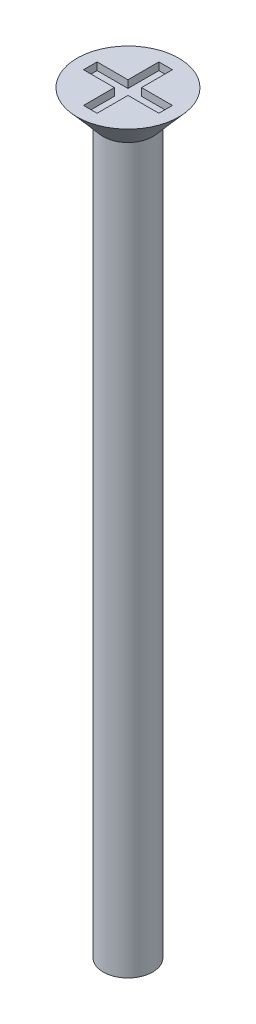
ISO-10303-21;
HEADER;
FILE_DESCRIPTION(('STEP AP214'),'2;1');
FILE_NAME('part.step','',(''),(''),'','','');
FILE_SCHEMA(('AUTOMOTIVE_DESIGN { 1 0 10303 214 1 1 1 1 }'));
ENDSEC;
DATA;
#1=APPLICATION_CONTEXT('core data for automotive mechanical design processes');
#2=APPLICATION_PROTOCOL_DEFINITION('international standard','automotive_design',2000,#1);
#3=PRODUCT_CONTEXT('',#1,'mechanical');
#4=PRODUCT('Part','Part','',(#3));
#5=PRODUCT_RELATED_PRODUCT_CATEGORY('part','',(#4));
#6=PRODUCT_DEFINITION_FORMATION('','',#4);
#7=PRODUCT_DEFINITION_CONTEXT('part definition',#1,'design');
#8=PRODUCT_DEFINITION('design','',#6,#7);
#9=PRODUCT_DEFINITION_SHAPE('','',#8);
#10=(LENGTH_UNIT() NAMED_UNIT(*) SI_UNIT(.MILLI.,.METRE.));
#11=(NAMED_UNIT(*) PLANE_ANGLE_UNIT() SI_UNIT($,.RADIAN.));
#12=(NAMED_UNIT(*) SI_UNIT($,.STERADIAN.) SOLID_ANGLE_UNIT());
#13=UNCERTAINTY_MEASURE_WITH_UNIT(LENGTH_MEASURE(1.E-05),#10,'distance_accuracy_value','');
#14=(GEOMETRIC_REPRESENTATION_CONTEXT(3) GLOBAL_UNCERTAINTY_ASSIGNED_CONTEXT((#13)) GLOBAL_UNIT_ASSIGNED_CONTEXT((#10,
#11,#12)) REPRESENTATION_CONTEXT('',''));
#15=CARTESIAN_POINT('',(0.,0.,0.));
#16=DIRECTION('',(0.,0.,1.));
#17=DIRECTION('',(1.,0.,0.));
#18=AXIS2_PLACEMENT_3D('',#15,#16,#17);
#19=CARTESIAN_POINT('',(4.2907883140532,63.5,0.));
#20=DIRECTION('',(0.,-1.,0.));
#21=DIRECTION('',(0.,0.,-1.));
#22=AXIS2_PLACEMENT_3D('',#19,#20,#21);
#23=PLANE('',#22);
#24=CARTESIAN_POINT('',(0.,63.5,0.));
#25=DIRECTION('',(0.,1.,0.));
#26=DIRECTION('',(0.,0.,1.));
#27=AXIS2_PLACEMENT_3D('',#24,#25,#26);
#28=CIRCLE('',#27,4.2907883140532);
#29=CARTESIAN_POINT('',(0.,63.5,4.2907883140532));
#30=VERTEX_POINT('',#29);
#31=EDGE_CURVE('E228',#30,#30,#28,.T.);
#32=ORIENTED_EDGE('',*,*,#31,.T.);
#33=EDGE_LOOP('',(#32));
#34=FACE_BOUND('',#33,.T.);
#35=DIRECTION('',(-1.,0.,1.49574714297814E-09));
#36=VECTOR('',#35,1.);
#37=CARTESIAN_POINT('',(8.54819492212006E-10,63.5,0.571499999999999));
#38=LINE('',#37,#36);
#39=CARTESIAN_POINT('',(-0.571500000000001,63.5,0.571500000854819));
#40=VERTEX_POINT('',#39);
#41=CARTESIAN_POINT('',(-3.17499999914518,63.5,0.571500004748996));
#42=VERTEX_POINT('',#41);
#43=EDGE_CURVE('E186',#40,#42,#38,.T.);
#44=ORIENTED_EDGE('',*,*,#43,.T.);
#45=DIRECTION('',(1.49574941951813E-09,0.,1.));
#46=VECTOR('',#45,1.);
#47=CARTESIAN_POINT('',(-3.17500000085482,63.5,-0.571499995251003));
#48=LINE('',#47,#46);
#49=CARTESIAN_POINT('',(-3.17500000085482,63.5,-0.571499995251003));
#50=VERTEX_POINT('',#49);
#51=EDGE_CURVE('E188',#50,#42,#48,.T.);
#52=ORIENTED_EDGE('',*,*,#51,.F.);
#53=DIRECTION('',(1.,0.,-1.49574727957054E-09));
#54=VECTOR('',#53,1.);
#55=CARTESIAN_POINT('',(-3.17500000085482,63.5,-0.571499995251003));
#56=LINE('',#55,#54);
#57=CARTESIAN_POINT('',(-0.571500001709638,63.5,-0.571500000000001));
#58=VERTEX_POINT('',#57);
#59=EDGE_CURVE('E191',#50,#58,#56,.T.);
#60=ORIENTED_EDGE('',*,*,#59,.T.);
#61=DIRECTION('',(-2.99149428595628E-09,0.,-1.));
#62=VECTOR('',#61,1.);
#63=CARTESIAN_POINT('',(-0.571499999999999,63.5,1.70963898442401E-09));
#64=LINE('',#63,#62);
#65=CARTESIAN_POINT('',(-0.571500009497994,63.5,-3.17499999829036));
#66=VERTEX_POINT('',#65);
#67=EDGE_CURVE('E165',#58,#66,#64,.T.);
#68=ORIENTED_EDGE('',*,*,#67,.T.);
#69=DIRECTION('',(-1.,0.,2.99149656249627E-09));
#70=VECTOR('',#69,1.);
#71=CARTESIAN_POINT('',(0.571499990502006,63.5,-3.17500000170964));
#72=LINE('',#71,#70);
#73=CARTESIAN_POINT('',(0.571499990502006,63.5,-3.17500000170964));
#74=VERTEX_POINT('',#73);
#75=EDGE_CURVE('E168',#74,#66,#72,.T.);
#76=ORIENTED_EDGE('',*,*,#75,.F.);
#77=DIRECTION('',(2.99149442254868E-09,0.,1.));
#78=VECTOR('',#77,1.);
#79=CARTESIAN_POINT('',(0.571499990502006,63.5,-3.17500000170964));
#80=LINE('',#79,#78);
#81=CARTESIAN_POINT('',(0.571500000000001,63.5,-0.571500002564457));
#82=VERTEX_POINT('',#81);
#83=EDGE_CURVE('E154',#74,#82,#80,.T.);
#84=ORIENTED_EDGE('',*,*,#83,.T.);
#85=DIRECTION('',(1.,0.,-4.48724098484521E-09));
#86=VECTOR('',#85,1.);
#87=CARTESIAN_POINT('',(-2.56445822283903E-09,63.5,-0.571499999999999));
#88=LINE('',#87,#86);
#89=CARTESIAN_POINT('',(3.17499999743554,63.5,-0.571500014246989));
#90=VERTEX_POINT('',#89);
#91=EDGE_CURVE('E134',#82,#90,#88,.T.);
#92=ORIENTED_EDGE('',*,*,#91,.T.);
#93=DIRECTION('',(-4.48724326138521E-09,0.,-1.));
#94=VECTOR('',#93,1.);
#95=CARTESIAN_POINT('',(3.17500000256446,63.5,0.57149998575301));
#96=LINE('',#95,#94);
#97=CARTESIAN_POINT('',(3.17500000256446,63.5,0.57149998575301));
#98=VERTEX_POINT('',#97);
#99=EDGE_CURVE('E144',#98,#90,#96,.T.);
#100=ORIENTED_EDGE('',*,*,#99,.F.);
#101=DIRECTION('',(-1.,0.,4.48724112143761E-09));
#102=VECTOR('',#101,1.);
#103=CARTESIAN_POINT('',(3.17500000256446,63.5,0.57149998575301));
#104=LINE('',#103,#102);
#105=CARTESIAN_POINT('',(0.571499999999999,63.5,0.571499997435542));
#106=VERTEX_POINT('',#105);
#107=EDGE_CURVE('E149',#98,#106,#104,.T.);
#108=ORIENTED_EDGE('',*,*,#107,.T.);
#109=DIRECTION('',(0.,0.,1.));
#110=VECTOR('',#109,1.);
#111=CARTESIAN_POINT('',(0.571499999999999,63.5,0.));
#112=LINE('',#111,#110);
#113=CARTESIAN_POINT('',(0.571499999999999,63.5,3.175));
#114=VERTEX_POINT('',#113);
#115=EDGE_CURVE('E211',#106,#114,#112,.T.);
#116=ORIENTED_EDGE('',*,*,#115,.T.);
#117=DIRECTION('',(1.,0.,0.));
#118=VECTOR('',#117,1.);
#119=CARTESIAN_POINT('',(-0.5715,63.5,3.175));
#120=LINE('',#119,#118);
#121=CARTESIAN_POINT('',(-0.5715,63.5,3.175));
#122=VERTEX_POINT('',#121);
#123=EDGE_CURVE('E213',#122,#114,#120,.T.);
#124=ORIENTED_EDGE('',*,*,#123,.F.);
#125=DIRECTION('',(0.,0.,-1.));
#126=VECTOR('',#125,1.);
#127=CARTESIAN_POINT('',(-0.5715,63.5,3.175));
#128=LINE('',#127,#126);
#129=EDGE_CURVE('E216',#122,#40,#128,.T.);
#130=ORIENTED_EDGE('',*,*,#129,.T.);
#131=EDGE_LOOP('',(#44,#52,#60,#68,#76,#84,#92,#100,#108,#116,#124,#130));
#132=FACE_BOUND('',#131,.T.);
#133=ADVANCED_FACE('F37',(#34,#132),#23,.F.);
#134=CARTESIAN_POINT('',(0.571499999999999,62.865,0.));
#135=DIRECTION('',(-1.,0.,0.));
#136=DIRECTION('',(0.,0.,1.));
#137=AXIS2_PLACEMENT_3D('',#134,#135,#136);
#138=PLANE('',#137);
#139=ORIENTED_EDGE('',*,*,#115,.F.);
#140=DIRECTION('',(0.,-1.,0.));
#141=VECTOR('',#140,1.);
#142=CARTESIAN_POINT('',(0.571499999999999,62.865,0.571499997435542));
#143=LINE('',#142,#141);
#144=CARTESIAN_POINT('',(0.571499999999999,62.865,0.571499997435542));
#145=VERTEX_POINT('',#144);
#146=EDGE_CURVE('E206',#106,#145,#143,.T.);
#147=ORIENTED_EDGE('',*,*,#146,.T.);
#148=DIRECTION('',(0.,0.,1.));
#149=VECTOR('',#148,1.);
#150=CARTESIAN_POINT('',(0.571499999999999,62.865,0.));
#151=LINE('',#150,#149);
#152=CARTESIAN_POINT('',(0.571499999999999,62.865,3.175));
#153=VERTEX_POINT('',#152);
#154=EDGE_CURVE('E60',#145,#153,#151,.T.);
#155=ORIENTED_EDGE('',*,*,#154,.T.);
#156=DIRECTION('',(0.,1.,0.));
#157=VECTOR('',#156,1.);
#158=CARTESIAN_POINT('',(0.571499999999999,62.865,3.175));
#159=LINE('',#158,#157);
#160=EDGE_CURVE('E226',#153,#114,#159,.T.);
#161=ORIENTED_EDGE('',*,*,#160,.T.);
#162=EDGE_LOOP('',(#139,#147,#155,#161));
#163=FACE_BOUND('',#162,.T.);
#164=ADVANCED_FACE('F245',(#163),#138,.T.);
#165=CARTESIAN_POINT('',(-0.5715,62.865,3.175));
#166=DIRECTION('',(1.,0.,0.));
#167=DIRECTION('',(0.,0.,-1.));
#168=AXIS2_PLACEMENT_3D('',#165,#166,#167);
#169=PLANE('',#168);
#170=DIRECTION('',(0.,0.,-1.));
#171=VECTOR('',#170,1.);
#172=CARTESIAN_POINT('',(-0.5715,62.865,3.175));
#173=LINE('',#172,#171);
#174=CARTESIAN_POINT('',(-0.5715,62.865,3.175));
#175=VERTEX_POINT('',#174);
#176=CARTESIAN_POINT('',(-0.571500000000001,62.865,0.571500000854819));
#177=VERTEX_POINT('',#176);
#178=EDGE_CURVE('E223',#175,#177,#173,.T.);
#179=ORIENTED_EDGE('',*,*,#178,.T.);
#180=DIRECTION('',(0.,1.,0.));
#181=VECTOR('',#180,1.);
#182=CARTESIAN_POINT('',(-0.571500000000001,62.865,0.571500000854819));
#183=LINE('',#182,#181);
#184=EDGE_CURVE('E208',#177,#40,#183,.T.);
#185=ORIENTED_EDGE('',*,*,#184,.T.);
#186=ORIENTED_EDGE('',*,*,#129,.F.);
#187=DIRECTION('',(0.,1.,0.));
#188=VECTOR('',#187,1.);
#189=CARTESIAN_POINT('',(-0.5715,62.865,3.175));
#190=LINE('',#189,#188);
#191=EDGE_CURVE('E52',#175,#122,#190,.T.);
#192=ORIENTED_EDGE('',*,*,#191,.F.);
#193=EDGE_LOOP('',(#179,#185,#186,#192));
#194=FACE_BOUND('',#193,.T.);
#195=ADVANCED_FACE('F241',(#194),#169,.T.);
#196=CARTESIAN_POINT('',(0.,0.,0.));
#197=DIRECTION('',(0.,1.,0.));
#198=DIRECTION('',(0.,0.,1.));
#199=AXIS2_PLACEMENT_3D('',#196,#197,#198);
#200=PLANE('',#199);
#201=CARTESIAN_POINT('',(0.,0.,0.));
#202=DIRECTION('',(0.,1.,0.));
#203=DIRECTION('',(0.,0.,1.));
#204=AXIS2_PLACEMENT_3D('',#201,#202,#203);
#205=CIRCLE('',#204,2.08280000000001);
#206=CARTESIAN_POINT('',(0.,0.,2.08280000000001));
#207=VERTEX_POINT('',#206);
#208=EDGE_CURVE('E11',#207,#207,#205,.T.);
#209=ORIENTED_EDGE('',*,*,#208,.F.);
#210=EDGE_LOOP('',(#209));
#211=FACE_BOUND('',#210,.T.);
#212=ADVANCED_FACE('F39',(#211),#200,.F.);
#213=CARTESIAN_POINT('',(0.,90.8693037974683,0.));
#214=DIRECTION('',(0.,1.,0.));
#215=DIRECTION('',(0.,0.,1.));
#216=AXIS2_PLACEMENT_3D('',#213,#214,#215);
#217=CYLINDRICAL_SURFACE('',#216,2.08280000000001);
#218=CARTESIAN_POINT('',(0.,60.96,0.));
#219=DIRECTION('',(0.,1.,0.));
#220=DIRECTION('',(0.,0.,1.));
#221=AXIS2_PLACEMENT_3D('',#218,#219,#220);
#222=CIRCLE('',#221,2.08280000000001);
#223=CARTESIAN_POINT('',(0.,60.96,2.08280000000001));
#224=VERTEX_POINT('',#223);
#225=EDGE_CURVE('E45',#224,#224,#222,.T.);
#226=ORIENTED_EDGE('',*,*,#225,.F.);
#227=EDGE_LOOP('',(#226));
#228=FACE_BOUND('',#227,.T.);
#229=ORIENTED_EDGE('',*,*,#208,.T.);
#230=EDGE_LOOP('',(#229));
#231=FACE_BOUND('',#230,.T.);
#232=ADVANCED_FACE('F235',(#228,#231),#217,.T.);
#233=CARTESIAN_POINT('',(0.,60.96,0.));
#234=DIRECTION('',(0.,1.,0.));
#235=DIRECTION('',(0.,0.,1.));
#236=AXIS2_PLACEMENT_3D('',#233,#234,#235);
#237=CONICAL_SURFACE('',#236,2.08280000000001,0.715584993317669);
#238=ORIENTED_EDGE('',*,*,#31,.F.);
#239=EDGE_LOOP('',(#238));
#240=FACE_BOUND('',#239,.T.);
#241=ORIENTED_EDGE('',*,*,#225,.T.);
#242=EDGE_LOOP('',(#241));
#243=FACE_BOUND('',#242,.T.);
#244=ADVANCED_FACE('F233',(#240,#243),#237,.T.);
#245=CARTESIAN_POINT('',(-0.5715,62.865,3.175));
#246=DIRECTION('',(0.,0.,1.));
#247=DIRECTION('',(1.,0.,0.));
#248=AXIS2_PLACEMENT_3D('',#245,#246,#247);
#249=PLANE('',#248);
#250=ORIENTED_EDGE('',*,*,#123,.T.);
#251=ORIENTED_EDGE('',*,*,#160,.F.);
#252=DIRECTION('',(1.,0.,0.));
#253=VECTOR('',#252,1.);
#254=CARTESIAN_POINT('',(-0.5715,62.865,3.175));
#255=LINE('',#254,#253);
#256=EDGE_CURVE('E220',#175,#153,#255,.T.);
#257=ORIENTED_EDGE('',*,*,#256,.F.);
#258=ORIENTED_EDGE('',*,*,#191,.T.);
#259=EDGE_LOOP('',(#250,#251,#257,#258));
#260=FACE_BOUND('',#259,.T.);
#261=ADVANCED_FACE('F257',(#260),#249,.F.);
#262=CARTESIAN_POINT('',(0.571499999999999,62.865,0.));
#263=DIRECTION('',(0.,-1.,0.));
#264=DIRECTION('',(0.,0.,-1.));
#265=AXIS2_PLACEMENT_3D('',#262,#263,#264);
#266=PLANE('',#265);
#267=ORIENTED_EDGE('',*,*,#154,.F.);
#268=DIRECTION('',(-1.,0.,4.48724112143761E-09));
#269=VECTOR('',#268,1.);
#270=CARTESIAN_POINT('',(3.17500000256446,62.865,0.57149998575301));
#271=LINE('',#270,#269);
#272=CARTESIAN_POINT('',(3.17500000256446,62.865,0.57149998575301));
#273=VERTEX_POINT('',#272);
#274=EDGE_CURVE('E161',#273,#145,#271,.T.);
#275=ORIENTED_EDGE('',*,*,#274,.F.);
#276=DIRECTION('',(-4.48724326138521E-09,0.,-1.));
#277=VECTOR('',#276,1.);
#278=CARTESIAN_POINT('',(3.17500000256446,62.865,0.57149998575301));
#279=LINE('',#278,#277);
#280=CARTESIAN_POINT('',(3.17499999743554,62.865,-0.571500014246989));
#281=VERTEX_POINT('',#280);
#282=EDGE_CURVE('E159',#273,#281,#279,.T.);
#283=ORIENTED_EDGE('',*,*,#282,.T.);
#284=DIRECTION('',(1.,0.,-4.48724098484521E-09));
#285=VECTOR('',#284,1.);
#286=CARTESIAN_POINT('',(-2.56445822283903E-09,62.865,-0.571499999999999));
#287=LINE('',#286,#285);
#288=CARTESIAN_POINT('',(0.571500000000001,62.865,-0.571500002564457));
#289=VERTEX_POINT('',#288);
#290=EDGE_CURVE('E136',#289,#281,#287,.T.);
#291=ORIENTED_EDGE('',*,*,#290,.F.);
#292=DIRECTION('',(2.99149442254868E-09,0.,1.));
#293=VECTOR('',#292,1.);
#294=CARTESIAN_POINT('',(0.571499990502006,62.865,-3.17500000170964));
#295=LINE('',#294,#293);
#296=CARTESIAN_POINT('',(0.571499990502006,62.865,-3.17500000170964));
#297=VERTEX_POINT('',#296);
#298=EDGE_CURVE('E177',#297,#289,#295,.T.);
#299=ORIENTED_EDGE('',*,*,#298,.F.);
#300=DIRECTION('',(-1.,0.,2.99149656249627E-09));
#301=VECTOR('',#300,1.);
#302=CARTESIAN_POINT('',(0.571499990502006,62.865,-3.17500000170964));
#303=LINE('',#302,#301);
#304=CARTESIAN_POINT('',(-0.571500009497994,62.865,-3.17499999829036));
#305=VERTEX_POINT('',#304);
#306=EDGE_CURVE('E174',#297,#305,#303,.T.);
#307=ORIENTED_EDGE('',*,*,#306,.T.);
#308=DIRECTION('',(-2.99149428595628E-09,0.,-1.));
#309=VECTOR('',#308,1.);
#310=CARTESIAN_POINT('',(-0.571499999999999,62.865,1.70963898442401E-09));
#311=LINE('',#310,#309);
#312=CARTESIAN_POINT('',(-0.571500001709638,62.865,-0.571500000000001));
#313=VERTEX_POINT('',#312);
#314=EDGE_CURVE('E172',#313,#305,#311,.T.);
#315=ORIENTED_EDGE('',*,*,#314,.F.);
#316=DIRECTION('',(1.,0.,-1.49574727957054E-09));
#317=VECTOR('',#316,1.);
#318=CARTESIAN_POINT('',(-3.17500000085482,62.865,-0.571499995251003));
#319=LINE('',#318,#317);
#320=CARTESIAN_POINT('',(-3.17500000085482,62.865,-0.571499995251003));
#321=VERTEX_POINT('',#320);
#322=EDGE_CURVE('E199',#321,#313,#319,.T.);
#323=ORIENTED_EDGE('',*,*,#322,.F.);
#324=DIRECTION('',(1.49574941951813E-09,0.,1.));
#325=VECTOR('',#324,1.);
#326=CARTESIAN_POINT('',(-3.17500000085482,62.865,-0.571499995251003));
#327=LINE('',#326,#325);
#328=CARTESIAN_POINT('',(-3.17499999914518,62.865,0.571500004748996));
#329=VERTEX_POINT('',#328);
#330=EDGE_CURVE('E196',#321,#329,#327,.T.);
#331=ORIENTED_EDGE('',*,*,#330,.T.);
#332=DIRECTION('',(-1.,0.,1.49574714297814E-09));
#333=VECTOR('',#332,1.);
#334=CARTESIAN_POINT('',(8.54819492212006E-10,62.865,0.571499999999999));
#335=LINE('',#334,#333);
#336=EDGE_CURVE('E194',#177,#329,#335,.T.);
#337=ORIENTED_EDGE('',*,*,#336,.F.);
#338=ORIENTED_EDGE('',*,*,#178,.F.);
#339=ORIENTED_EDGE('',*,*,#256,.T.);
#340=EDGE_LOOP('',(#267,#275,#283,#291,#299,#307,#315,#323,#331,#337,#338,#339));
#341=FACE_BOUND('',#340,.T.);
#342=ADVANCED_FACE('F262',(#341),#266,.F.);
#343=CARTESIAN_POINT('',(-3.17500000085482,62.865,-0.571499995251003));
#344=DIRECTION('',(1.49574727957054E-09,0.,1.));
#345=DIRECTION('',(1.,0.,-1.49574727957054E-09));
#346=AXIS2_PLACEMENT_3D('',#343,#344,#345);
#347=PLANE('',#346);
#348=DIRECTION('',(0.,1.,0.));
#349=VECTOR('',#348,1.);
#350=CARTESIAN_POINT('',(-0.571500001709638,62.865,-0.571499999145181));
#351=LINE('',#350,#349);
#352=EDGE_CURVE('E184',#313,#58,#351,.T.);
#353=ORIENTED_EDGE('',*,*,#352,.T.);
#354=ORIENTED_EDGE('',*,*,#59,.F.);
#355=DIRECTION('',(0.,1.,0.));
#356=VECTOR('',#355,1.);
#357=CARTESIAN_POINT('',(-3.17500000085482,62.865,-0.571499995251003));
#358=LINE('',#357,#356);
#359=EDGE_CURVE('E202',#321,#50,#358,.T.);
#360=ORIENTED_EDGE('',*,*,#359,.F.);
#361=ORIENTED_EDGE('',*,*,#322,.T.);
#362=EDGE_LOOP('',(#353,#354,#360,#361));
#363=FACE_BOUND('',#362,.T.);
#364=ADVANCED_FACE('F269',(#363),#347,.T.);
#365=CARTESIAN_POINT('',(8.54819492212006E-10,62.865,0.571499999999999));
#366=DIRECTION('',(-1.49574714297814E-09,0.,-1.));
#367=DIRECTION('',(-1.,0.,1.49574714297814E-09));
#368=AXIS2_PLACEMENT_3D('',#365,#366,#367);
#369=PLANE('',#368);
#370=ORIENTED_EDGE('',*,*,#336,.T.);
#371=DIRECTION('',(0.,1.,0.));
#372=VECTOR('',#371,1.);
#373=CARTESIAN_POINT('',(-3.17499999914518,62.865,0.571500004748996));
#374=LINE('',#373,#372);
#375=EDGE_CURVE('E204',#329,#42,#374,.T.);
#376=ORIENTED_EDGE('',*,*,#375,.T.);
#377=ORIENTED_EDGE('',*,*,#43,.F.);
#378=ORIENTED_EDGE('',*,*,#184,.F.);
#379=EDGE_LOOP('',(#370,#376,#377,#378));
#380=FACE_BOUND('',#379,.T.);
#381=ADVANCED_FACE('F273',(#380),#369,.T.);
#382=CARTESIAN_POINT('',(-3.17500000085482,62.865,-0.571499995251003));
#383=DIRECTION('',(-1.,0.,1.49574941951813E-09));
#384=DIRECTION('',(1.49574941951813E-09,0.,1.));
#385=AXIS2_PLACEMENT_3D('',#382,#383,#384);
#386=PLANE('',#385);
#387=ORIENTED_EDGE('',*,*,#51,.T.);
#388=ORIENTED_EDGE('',*,*,#375,.F.);
#389=ORIENTED_EDGE('',*,*,#330,.F.);
#390=ORIENTED_EDGE('',*,*,#359,.T.);
#391=EDGE_LOOP('',(#387,#388,#389,#390));
#392=FACE_BOUND('',#391,.T.);
#393=ADVANCED_FACE('F276',(#392),#386,.F.);
#394=CARTESIAN_POINT('',(-0.571499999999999,62.865,1.70963898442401E-09));
#395=DIRECTION('',(1.,0.,-2.99149428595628E-09));
#396=DIRECTION('',(-2.99149428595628E-09,0.,-1.));
#397=AXIS2_PLACEMENT_3D('',#394,#395,#396);
#398=PLANE('',#397);
#399=ORIENTED_EDGE('',*,*,#314,.T.);
#400=DIRECTION('',(0.,1.,0.));
#401=VECTOR('',#400,1.);
#402=CARTESIAN_POINT('',(-0.571500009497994,62.865,-3.17499999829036));
#403=LINE('',#402,#401);
#404=EDGE_CURVE('E182',#305,#66,#403,.T.);
#405=ORIENTED_EDGE('',*,*,#404,.T.);
#406=ORIENTED_EDGE('',*,*,#67,.F.);
#407=ORIENTED_EDGE('',*,*,#352,.F.);
#408=EDGE_LOOP('',(#399,#405,#406,#407));
#409=FACE_BOUND('',#408,.T.);
#410=ADVANCED_FACE('F280',(#409),#398,.T.);
#411=CARTESIAN_POINT('',(0.571499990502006,62.865,-3.17500000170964));
#412=DIRECTION('',(-1.,0.,2.99149442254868E-09));
#413=DIRECTION('',(2.99149442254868E-09,0.,1.));
#414=AXIS2_PLACEMENT_3D('',#411,#412,#413);
#415=PLANE('',#414);
#416=DIRECTION('',(0.,1.,0.));
#417=VECTOR('',#416,1.);
#418=CARTESIAN_POINT('',(0.571499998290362,62.865,-0.571500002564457));
#419=LINE('',#418,#417);
#420=EDGE_CURVE('E140',#289,#82,#419,.T.);
#421=ORIENTED_EDGE('',*,*,#420,.T.);
#422=ORIENTED_EDGE('',*,*,#83,.F.);
#423=DIRECTION('',(0.,1.,0.));
#424=VECTOR('',#423,1.);
#425=CARTESIAN_POINT('',(0.571499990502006,62.865,-3.17500000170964));
#426=LINE('',#425,#424);
#427=EDGE_CURVE('E180',#297,#74,#426,.T.);
#428=ORIENTED_EDGE('',*,*,#427,.F.);
#429=ORIENTED_EDGE('',*,*,#298,.T.);
#430=EDGE_LOOP('',(#421,#422,#428,#429));
#431=FACE_BOUND('',#430,.T.);
#432=ADVANCED_FACE('F287',(#431),#415,.T.);
#433=CARTESIAN_POINT('',(0.571499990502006,62.865,-3.17500000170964));
#434=DIRECTION('',(-2.99149656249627E-09,0.,-1.));
#435=DIRECTION('',(-1.,0.,2.99149656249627E-09));
#436=AXIS2_PLACEMENT_3D('',#433,#434,#435);
#437=PLANE('',#436);
#438=ORIENTED_EDGE('',*,*,#75,.T.);
#439=ORIENTED_EDGE('',*,*,#404,.F.);
#440=ORIENTED_EDGE('',*,*,#306,.F.);
#441=ORIENTED_EDGE('',*,*,#427,.T.);
#442=EDGE_LOOP('',(#438,#439,#440,#441));
#443=FACE_BOUND('',#442,.T.);
#444=ADVANCED_FACE('F289',(#443),#437,.F.);
#445=CARTESIAN_POINT('',(-2.56445822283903E-09,62.865,-0.571499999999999));
#446=DIRECTION('',(4.48724098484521E-09,0.,1.));
#447=DIRECTION('',(1.,0.,-4.48724098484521E-09));
#448=AXIS2_PLACEMENT_3D('',#445,#446,#447);
#449=PLANE('',#448);
#450=ORIENTED_EDGE('',*,*,#290,.T.);
#451=DIRECTION('',(0.,1.,0.));
#452=VECTOR('',#451,1.);
#453=CARTESIAN_POINT('',(3.17499999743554,62.865,-0.571500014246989));
#454=LINE('',#453,#452);
#455=EDGE_CURVE('E129',#281,#90,#454,.T.);
#456=ORIENTED_EDGE('',*,*,#455,.T.);
#457=ORIENTED_EDGE('',*,*,#91,.F.);
#458=ORIENTED_EDGE('',*,*,#420,.F.);
#459=EDGE_LOOP('',(#450,#456,#457,#458));
#460=FACE_BOUND('',#459,.T.);
#461=ADVANCED_FACE('F131',(#460),#449,.T.);
#462=CARTESIAN_POINT('',(3.17500000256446,62.865,0.57149998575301));
#463=DIRECTION('',(1.,0.,-4.4872432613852E-09));
#464=DIRECTION('',(-4.4872432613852E-09,0.,-1.));
#465=AXIS2_PLACEMENT_3D('',#462,#463,#464);
#466=PLANE('',#465);
#467=ORIENTED_EDGE('',*,*,#99,.T.);
#468=ORIENTED_EDGE('',*,*,#455,.F.);
#469=ORIENTED_EDGE('',*,*,#282,.F.);
#470=DIRECTION('',(0.,1.,0.));
#471=VECTOR('',#470,1.);
#472=CARTESIAN_POINT('',(3.17500000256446,62.865,0.57149998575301));
#473=LINE('',#472,#471);
#474=EDGE_CURVE('E141',#273,#98,#473,.T.);
#475=ORIENTED_EDGE('',*,*,#474,.T.);
#476=EDGE_LOOP('',(#467,#468,#469,#475));
#477=FACE_BOUND('',#476,.T.);
#478=ADVANCED_FACE('F145',(#477),#466,.F.);
#479=CARTESIAN_POINT('',(3.17500000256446,62.865,0.57149998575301));
#480=DIRECTION('',(-4.48724112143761E-09,0.,-1.));
#481=DIRECTION('',(-1.,0.,4.48724112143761E-09));
#482=AXIS2_PLACEMENT_3D('',#479,#480,#481);
#483=PLANE('',#482);
#484=ORIENTED_EDGE('',*,*,#107,.F.);
#485=ORIENTED_EDGE('',*,*,#474,.F.);
#486=ORIENTED_EDGE('',*,*,#274,.T.);
#487=ORIENTED_EDGE('',*,*,#146,.F.);
#488=EDGE_LOOP('',(#484,#485,#486,#487));
#489=FACE_BOUND('',#488,.T.);
#490=ADVANCED_FACE('F300',(#489),#483,.T.);
#491=CLOSED_SHELL('',(#133,#164,#195,#212,#232,#244,#261,#342,#364,#381,#393,#410,#432,#444,
#461,#478,#490));
#492=MANIFOLD_SOLID_BREP('B2',#491);
#493=ADVANCED_BREP_SHAPE_REPRESENTATION('',(#18,#492),#14);
#494=SHAPE_DEFINITION_REPRESENTATION(#9,#493);
ENDSEC;
END-ISO-10303-21;
